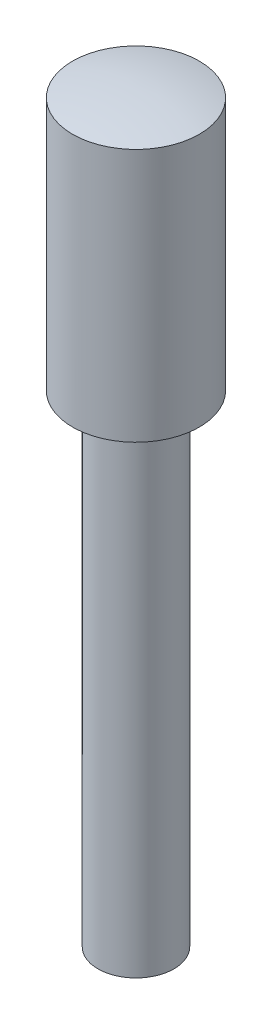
ISO-10303-21;
HEADER;
FILE_DESCRIPTION(('STEP AP214'),'2;1');
FILE_NAME('part.step','',(''),(''),'','','');
FILE_SCHEMA(('AUTOMOTIVE_DESIGN { 1 0 10303 214 1 1 1 1 }'));
ENDSEC;
DATA;
#1=APPLICATION_CONTEXT('core data for automotive mechanical design processes');
#2=APPLICATION_PROTOCOL_DEFINITION('international standard','automotive_design',2000,#1);
#3=PRODUCT_CONTEXT('',#1,'mechanical');
#4=PRODUCT('Part','Part','',(#3));
#5=PRODUCT_RELATED_PRODUCT_CATEGORY('part','',(#4));
#6=PRODUCT_DEFINITION_FORMATION('','',#4);
#7=PRODUCT_DEFINITION_CONTEXT('part definition',#1,'design');
#8=PRODUCT_DEFINITION('design','',#6,#7);
#9=PRODUCT_DEFINITION_SHAPE('','',#8);
#10=(LENGTH_UNIT() NAMED_UNIT(*) SI_UNIT(.MILLI.,.METRE.));
#11=(NAMED_UNIT(*) PLANE_ANGLE_UNIT() SI_UNIT($,.RADIAN.));
#12=(NAMED_UNIT(*) SI_UNIT($,.STERADIAN.) SOLID_ANGLE_UNIT());
#13=UNCERTAINTY_MEASURE_WITH_UNIT(LENGTH_MEASURE(1.E-05),#10,'distance_accuracy_value','');
#14=(GEOMETRIC_REPRESENTATION_CONTEXT(3) GLOBAL_UNCERTAINTY_ASSIGNED_CONTEXT((#13)) GLOBAL_UNIT_ASSIGNED_CONTEXT((#10,
#11,#12)) REPRESENTATION_CONTEXT('',''));
#15=CARTESIAN_POINT('',(0.,0.,0.));
#16=DIRECTION('',(0.,0.,1.));
#17=DIRECTION('',(1.,0.,0.));
#18=AXIS2_PLACEMENT_3D('',#15,#16,#17);
#19=CARTESIAN_POINT('',(0.749999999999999,5.56921046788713,0.));
#20=DIRECTION('',(0.,1.,0.));
#21=DIRECTION('',(-1.,0.,0.));
#22=AXIS2_PLACEMENT_3D('',#19,#20,#21);
#23=CYLINDRICAL_SURFACE('',#22,0.75);
#24=CARTESIAN_POINT('',(0.750000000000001,-9.5,0.));
#25=DIRECTION('',(0.,1.,0.));
#26=DIRECTION('',(-1.,0.,0.));
#27=AXIS2_PLACEMENT_3D('',#24,#25,#26);
#28=CIRCLE('',#27,0.75);
#29=CARTESIAN_POINT('',(0.,-9.5,0.));
#30=VERTEX_POINT('',#29);
#31=EDGE_CURVE('E10',#30,#30,#28,.T.);
#32=ORIENTED_EDGE('',*,*,#31,.T.);
#33=EDGE_LOOP('',(#32));
#34=FACE_BOUND('',#33,.T.);
#35=CARTESIAN_POINT('',(0.75,0.,0.));
#36=DIRECTION('',(0.,1.,0.));
#37=DIRECTION('',(-1.,0.,0.));
#38=AXIS2_PLACEMENT_3D('',#35,#36,#37);
#39=CIRCLE('',#38,0.75);
#40=CARTESIAN_POINT('',(0.,0.,0.));
#41=VERTEX_POINT('',#40);
#42=EDGE_CURVE('E45',#41,#41,#39,.T.);
#43=ORIENTED_EDGE('',*,*,#42,.F.);
#44=EDGE_LOOP('',(#43));
#45=FACE_BOUND('',#44,.T.);
#46=ADVANCED_FACE('F31',(#34,#45),#23,.T.);
#47=CARTESIAN_POINT('',(0.750000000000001,-7.5,0.));
#48=DIRECTION('',(0.,1.,0.));
#49=DIRECTION('',(-1.,0.,0.));
#50=AXIS2_PLACEMENT_3D('',#47,#48,#49);
#51=SPHERICAL_SURFACE('',#50,2.13600093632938);
#52=ORIENTED_EDGE('',*,*,#31,.F.);
#53=EDGE_LOOP('',(#52));
#54=FACE_BOUND('',#53,.T.);
#55=ADVANCED_FACE('F55',(#54),#51,.T.);
#56=CARTESIAN_POINT('',(0.75,0.,0.));
#57=DIRECTION('',(0.,1.,0.));
#58=DIRECTION('',(1.,0.,0.));
#59=AXIS2_PLACEMENT_3D('',#56,#57,#58);
#60=SPHERICAL_SURFACE('',#59,5.15388203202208);
#61=CARTESIAN_POINT('',(0.749999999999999,5.,0.));
#62=DIRECTION('',(0.,1.,0.));
#63=DIRECTION('',(-1.,0.,0.));
#64=AXIS2_PLACEMENT_3D('',#61,#62,#63);
#65=CIRCLE('',#64,1.25);
#66=CARTESIAN_POINT('',(-0.5,5.,0.));
#67=VERTEX_POINT('',#66);
#68=EDGE_CURVE('E37',#67,#67,#65,.T.);
#69=ORIENTED_EDGE('',*,*,#68,.T.);
#70=EDGE_LOOP('',(#69));
#71=FACE_BOUND('',#70,.T.);
#72=ADVANCED_FACE('F59',(#71),#60,.T.);
#73=CARTESIAN_POINT('',(0.749999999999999,5.56921046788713,0.));
#74=DIRECTION('',(0.,1.,0.));
#75=DIRECTION('',(-1.,0.,0.));
#76=AXIS2_PLACEMENT_3D('',#73,#74,#75);
#77=CYLINDRICAL_SURFACE('',#76,1.25);
#78=CARTESIAN_POINT('',(0.75,0.,0.));
#79=DIRECTION('',(0.,1.,0.));
#80=DIRECTION('',(-1.,0.,0.));
#81=AXIS2_PLACEMENT_3D('',#78,#79,#80);
#82=CIRCLE('',#81,1.25);
#83=CARTESIAN_POINT('',(-0.5,0.,0.));
#84=VERTEX_POINT('',#83);
#85=EDGE_CURVE('E41',#84,#84,#82,.T.);
#86=ORIENTED_EDGE('',*,*,#85,.T.);
#87=EDGE_LOOP('',(#86));
#88=FACE_BOUND('',#87,.T.);
#89=ORIENTED_EDGE('',*,*,#68,.F.);
#90=EDGE_LOOP('',(#89));
#91=FACE_BOUND('',#90,.T.);
#92=ADVANCED_FACE('F64',(#88,#91),#77,.T.);
#93=CARTESIAN_POINT('',(0.,0.,0.));
#94=DIRECTION('',(0.,-1.,0.));
#95=DIRECTION('',(1.,0.,0.));
#96=AXIS2_PLACEMENT_3D('',#93,#94,#95);
#97=PLANE('',#96);
#98=ORIENTED_EDGE('',*,*,#42,.T.);
#99=EDGE_LOOP('',(#98));
#100=FACE_BOUND('',#99,.T.);
#101=ORIENTED_EDGE('',*,*,#85,.F.);
#102=EDGE_LOOP('',(#101));
#103=FACE_BOUND('',#102,.T.);
#104=ADVANCED_FACE('F51',(#100,#103),#97,.T.);
#105=CLOSED_SHELL('',(#46,#55,#72,#92,#104));
#106=MANIFOLD_SOLID_BREP('B2',#105);
#107=ADVANCED_BREP_SHAPE_REPRESENTATION('',(#18,#106),#14);
#108=SHAPE_DEFINITION_REPRESENTATION(#9,#107);
ENDSEC;
END-ISO-10303-21;
